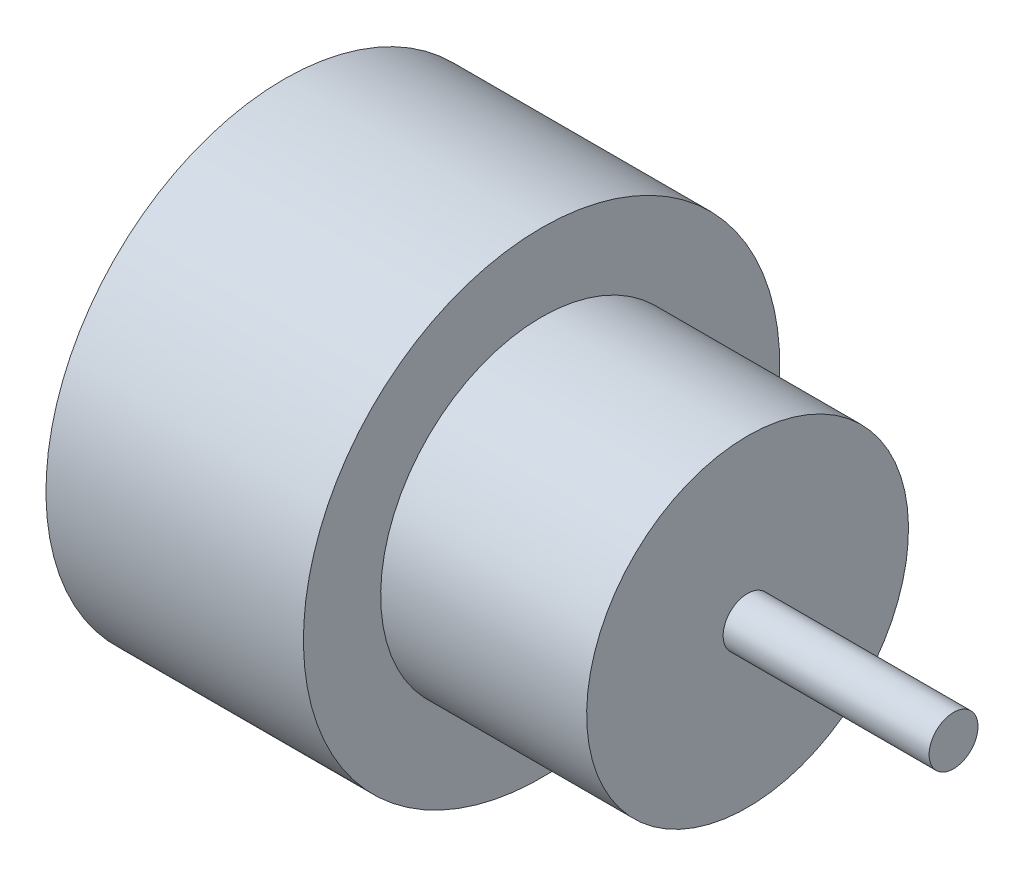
ISO-10303-21;
HEADER;
FILE_DESCRIPTION(('STEP AP214'),'2;1');
FILE_NAME('part.step','',(''),(''),'','','');
FILE_SCHEMA(('AUTOMOTIVE_DESIGN { 1 0 10303 214 1 1 1 1 }'));
ENDSEC;
DATA;
#1=APPLICATION_CONTEXT('core data for automotive mechanical design processes');
#2=APPLICATION_PROTOCOL_DEFINITION('international standard','automotive_design',2000,#1);
#3=PRODUCT_CONTEXT('',#1,'mechanical');
#4=PRODUCT('Part','Part','',(#3));
#5=PRODUCT_RELATED_PRODUCT_CATEGORY('part','',(#4));
#6=PRODUCT_DEFINITION_FORMATION('','',#4);
#7=PRODUCT_DEFINITION_CONTEXT('part definition',#1,'design');
#8=PRODUCT_DEFINITION('design','',#6,#7);
#9=PRODUCT_DEFINITION_SHAPE('','',#8);
#10=(LENGTH_UNIT() NAMED_UNIT(*) SI_UNIT(.MILLI.,.METRE.));
#11=(NAMED_UNIT(*) PLANE_ANGLE_UNIT() SI_UNIT($,.RADIAN.));
#12=(NAMED_UNIT(*) SI_UNIT($,.STERADIAN.) SOLID_ANGLE_UNIT());
#13=UNCERTAINTY_MEASURE_WITH_UNIT(LENGTH_MEASURE(1.E-05),#10,'distance_accuracy_value','');
#14=(GEOMETRIC_REPRESENTATION_CONTEXT(3) GLOBAL_UNCERTAINTY_ASSIGNED_CONTEXT((#13)) GLOBAL_UNIT_ASSIGNED_CONTEXT((#10,
#11,#12)) REPRESENTATION_CONTEXT('',''));
#15=CARTESIAN_POINT('',(0.,0.,0.));
#16=DIRECTION('',(0.,0.,1.));
#17=DIRECTION('',(1.,0.,0.));
#18=AXIS2_PLACEMENT_3D('',#15,#16,#17);
#19=CARTESIAN_POINT('',(0.56,0.,0.));
#20=DIRECTION('',(-1.,0.,0.));
#21=DIRECTION('',(0.,-1.,0.));
#22=AXIS2_PLACEMENT_3D('',#19,#20,#21);
#23=PLANE('',#22);
#24=CARTESIAN_POINT('',(0.56,0.,0.));
#25=DIRECTION('',(1.,0.,0.));
#26=DIRECTION('',(0.,1.,0.));
#27=AXIS2_PLACEMENT_3D('',#24,#25,#26);
#28=CIRCLE('',#27,0.19);
#29=CARTESIAN_POINT('',(0.56,0.19,0.));
#30=VERTEX_POINT('',#29);
#31=EDGE_CURVE('E18',#30,#30,#28,.T.);
#32=ORIENTED_EDGE('',*,*,#31,.F.);
#33=EDGE_LOOP('',(#32));
#34=FACE_BOUND('',#33,.T.);
#35=ADVANCED_FACE('F15',(#34),#23,.T.);
#36=CARTESIAN_POINT('',(5.2,0.19,0.));
#37=DIRECTION('',(1.,0.,0.));
#38=DIRECTION('',(0.,1.,0.));
#39=AXIS2_PLACEMENT_3D('',#36,#37,#38);
#40=PLANE('',#39);
#41=CARTESIAN_POINT('',(5.2,0.,0.));
#42=DIRECTION('',(1.,0.,0.));
#43=DIRECTION('',(0.,1.,0.));
#44=AXIS2_PLACEMENT_3D('',#41,#42,#43);
#45=CIRCLE('',#44,0.19);
#46=CARTESIAN_POINT('',(5.2,0.19,0.));
#47=VERTEX_POINT('',#46);
#48=EDGE_CURVE('E46',#47,#47,#45,.F.);
#49=ORIENTED_EDGE('',*,*,#48,.F.);
#50=EDGE_LOOP('',(#49));
#51=FACE_BOUND('',#50,.T.);
#52=ADVANCED_FACE('F57',(#51),#40,.T.);
#53=CARTESIAN_POINT('',(5.2,0.,0.));
#54=DIRECTION('',(1.,0.,0.));
#55=DIRECTION('',(0.,1.,0.));
#56=AXIS2_PLACEMENT_3D('',#53,#54,#55);
#57=CYLINDRICAL_SURFACE('',#56,0.19);
#58=ORIENTED_EDGE('',*,*,#31,.T.);
#59=EDGE_LOOP('',(#58));
#60=FACE_BOUND('',#59,.T.);
#61=CARTESIAN_POINT('',(1.7,0.,0.));
#62=DIRECTION('',(1.,0.,0.));
#63=DIRECTION('',(0.,1.,0.));
#64=AXIS2_PLACEMENT_3D('',#61,#62,#63);
#65=CIRCLE('',#64,0.19);
#66=CARTESIAN_POINT('',(1.7,0.19,0.));
#67=VERTEX_POINT('',#66);
#68=EDGE_CURVE('E44',#67,#67,#65,.T.);
#69=ORIENTED_EDGE('',*,*,#68,.F.);
#70=EDGE_LOOP('',(#69));
#71=FACE_BOUND('',#70,.T.);
#72=ADVANCED_FACE('F53',(#60,#71),#57,.T.);
#73=CARTESIAN_POINT('',(5.2,0.,0.));
#74=DIRECTION('',(1.,0.,0.));
#75=DIRECTION('',(0.,1.,0.));
#76=AXIS2_PLACEMENT_3D('',#73,#74,#75);
#77=CYLINDRICAL_SURFACE('',#76,0.19);
#78=CARTESIAN_POINT('',(3.6,0.,0.));
#79=DIRECTION('',(1.,0.,0.));
#80=DIRECTION('',(0.,1.,0.));
#81=AXIS2_PLACEMENT_3D('',#78,#79,#80);
#82=CIRCLE('',#81,0.19);
#83=CARTESIAN_POINT('',(3.6,0.19,0.));
#84=VERTEX_POINT('',#83);
#85=EDGE_CURVE('E41',#84,#84,#82,.F.);
#86=ORIENTED_EDGE('',*,*,#85,.F.);
#87=EDGE_LOOP('',(#86));
#88=FACE_BOUND('',#87,.T.);
#89=ORIENTED_EDGE('',*,*,#48,.T.);
#90=EDGE_LOOP('',(#89));
#91=FACE_BOUND('',#90,.T.);
#92=ADVANCED_FACE('F93',(#88,#91),#77,.T.);
#93=CARTESIAN_POINT('',(1.7,0.19,0.));
#94=DIRECTION('',(-1.,0.,0.));
#95=DIRECTION('',(0.,-1.,0.));
#96=AXIS2_PLACEMENT_3D('',#93,#94,#95);
#97=PLANE('',#96);
#98=CARTESIAN_POINT('',(1.7,0.,0.));
#99=DIRECTION('',(1.,0.,0.));
#100=DIRECTION('',(0.,1.,0.));
#101=AXIS2_PLACEMENT_3D('',#98,#99,#100);
#102=CIRCLE('',#101,1.55);
#103=CARTESIAN_POINT('',(1.7,1.55,0.));
#104=VERTEX_POINT('',#103);
#105=EDGE_CURVE('E38',#104,#104,#102,.F.);
#106=ORIENTED_EDGE('',*,*,#105,.T.);
#107=EDGE_LOOP('',(#106));
#108=FACE_BOUND('',#107,.T.);
#109=ORIENTED_EDGE('',*,*,#68,.T.);
#110=EDGE_LOOP('',(#109));
#111=FACE_BOUND('',#110,.T.);
#112=ADVANCED_FACE('F89',(#108,#111),#97,.T.);
#113=CARTESIAN_POINT('',(3.6,1.25,0.));
#114=DIRECTION('',(1.,0.,0.));
#115=DIRECTION('',(0.,1.,0.));
#116=AXIS2_PLACEMENT_3D('',#113,#114,#115);
#117=PLANE('',#116);
#118=ORIENTED_EDGE('',*,*,#85,.T.);
#119=EDGE_LOOP('',(#118));
#120=FACE_BOUND('',#119,.T.);
#121=CARTESIAN_POINT('',(3.6,0.,0.));
#122=DIRECTION('',(1.,0.,0.));
#123=DIRECTION('',(0.,1.,0.));
#124=AXIS2_PLACEMENT_3D('',#121,#122,#123);
#125=CIRCLE('',#124,1.25);
#126=CARTESIAN_POINT('',(3.6,1.25,0.));
#127=VERTEX_POINT('',#126);
#128=EDGE_CURVE('E35',#127,#127,#125,.F.);
#129=ORIENTED_EDGE('',*,*,#128,.F.);
#130=EDGE_LOOP('',(#129));
#131=FACE_BOUND('',#130,.T.);
#132=ADVANCED_FACE('F85',(#120,#131),#117,.T.);
#133=CARTESIAN_POINT('',(5.2,0.,0.));
#134=DIRECTION('',(1.,0.,0.));
#135=DIRECTION('',(0.,1.,0.));
#136=AXIS2_PLACEMENT_3D('',#133,#134,#135);
#137=CYLINDRICAL_SURFACE('',#136,1.55);
#138=ORIENTED_EDGE('',*,*,#105,.F.);
#139=EDGE_LOOP('',(#138));
#140=FACE_BOUND('',#139,.T.);
#141=CARTESIAN_POINT('',(0.,0.,0.));
#142=DIRECTION('',(1.,0.,0.));
#143=DIRECTION('',(0.,1.,0.));
#144=AXIS2_PLACEMENT_3D('',#141,#142,#143);
#145=CIRCLE('',#144,1.55);
#146=CARTESIAN_POINT('',(0.,1.55,0.));
#147=VERTEX_POINT('',#146);
#148=EDGE_CURVE('E32',#147,#147,#145,.T.);
#149=ORIENTED_EDGE('',*,*,#148,.F.);
#150=EDGE_LOOP('',(#149));
#151=FACE_BOUND('',#150,.T.);
#152=ADVANCED_FACE('F81',(#140,#151),#137,.F.);
#153=CARTESIAN_POINT('',(5.2,0.,0.));
#154=DIRECTION('',(1.,0.,0.));
#155=DIRECTION('',(0.,1.,0.));
#156=AXIS2_PLACEMENT_3D('',#153,#154,#155);
#157=CYLINDRICAL_SURFACE('',#156,1.25);
#158=CARTESIAN_POINT('',(2.,0.,0.));
#159=DIRECTION('',(1.,0.,0.));
#160=DIRECTION('',(0.,1.,0.));
#161=AXIS2_PLACEMENT_3D('',#158,#159,#160);
#162=CIRCLE('',#161,1.25);
#163=CARTESIAN_POINT('',(2.,1.25,0.));
#164=VERTEX_POINT('',#163);
#165=EDGE_CURVE('E27',#164,#164,#162,.F.);
#166=ORIENTED_EDGE('',*,*,#165,.F.);
#167=EDGE_LOOP('',(#166));
#168=FACE_BOUND('',#167,.T.);
#169=ORIENTED_EDGE('',*,*,#128,.T.);
#170=EDGE_LOOP('',(#169));
#171=FACE_BOUND('',#170,.T.);
#172=ADVANCED_FACE('F77',(#168,#171),#157,.T.);
#173=CARTESIAN_POINT('',(0.,1.55,0.));
#174=DIRECTION('',(-1.,0.,0.));
#175=DIRECTION('',(0.,-1.,0.));
#176=AXIS2_PLACEMENT_3D('',#173,#174,#175);
#177=PLANE('',#176);
#178=CARTESIAN_POINT('',(0.,0.,0.));
#179=DIRECTION('',(1.,0.,0.));
#180=DIRECTION('',(0.,1.,0.));
#181=AXIS2_PLACEMENT_3D('',#178,#179,#180);
#182=CIRCLE('',#181,1.85);
#183=CARTESIAN_POINT('',(0.,1.85,0.));
#184=VERTEX_POINT('',#183);
#185=EDGE_CURVE('E22',#184,#184,#182,.T.);
#186=ORIENTED_EDGE('',*,*,#185,.F.);
#187=EDGE_LOOP('',(#186));
#188=FACE_BOUND('',#187,.T.);
#189=ORIENTED_EDGE('',*,*,#148,.T.);
#190=EDGE_LOOP('',(#189));
#191=FACE_BOUND('',#190,.T.);
#192=ADVANCED_FACE('F70',(#188,#191),#177,.T.);
#193=CARTESIAN_POINT('',(2.,1.85,0.));
#194=DIRECTION('',(1.,0.,0.));
#195=DIRECTION('',(0.,1.,0.));
#196=AXIS2_PLACEMENT_3D('',#193,#194,#195);
#197=PLANE('',#196);
#198=ORIENTED_EDGE('',*,*,#165,.T.);
#199=EDGE_LOOP('',(#198));
#200=FACE_BOUND('',#199,.T.);
#201=CARTESIAN_POINT('',(2.,0.,0.));
#202=DIRECTION('',(1.,0.,0.));
#203=DIRECTION('',(0.,1.,0.));
#204=AXIS2_PLACEMENT_3D('',#201,#202,#203);
#205=CIRCLE('',#204,1.85);
#206=CARTESIAN_POINT('',(2.,1.85,0.));
#207=VERTEX_POINT('',#206);
#208=EDGE_CURVE('E10',#207,#207,#205,.F.);
#209=ORIENTED_EDGE('',*,*,#208,.F.);
#210=EDGE_LOOP('',(#209));
#211=FACE_BOUND('',#210,.T.);
#212=ADVANCED_FACE('F65',(#200,#211),#197,.T.);
#213=CARTESIAN_POINT('',(5.2,0.,0.));
#214=DIRECTION('',(1.,0.,0.));
#215=DIRECTION('',(0.,1.,0.));
#216=AXIS2_PLACEMENT_3D('',#213,#214,#215);
#217=CYLINDRICAL_SURFACE('',#216,1.85);
#218=ORIENTED_EDGE('',*,*,#208,.T.);
#219=EDGE_LOOP('',(#218));
#220=FACE_BOUND('',#219,.T.);
#221=ORIENTED_EDGE('',*,*,#185,.T.);
#222=EDGE_LOOP('',(#221));
#223=FACE_BOUND('',#222,.T.);
#224=ADVANCED_FACE('F63',(#220,#223),#217,.T.);
#225=CLOSED_SHELL('',(#35,#52,#72,#92,#112,#132,#152,#172,#192,#212,#224));
#226=MANIFOLD_SOLID_BREP('B1',#225);
#227=ADVANCED_BREP_SHAPE_REPRESENTATION('',(#18,#226),#14);
#228=SHAPE_DEFINITION_REPRESENTATION(#9,#227);
ENDSEC;
END-ISO-10303-21;
